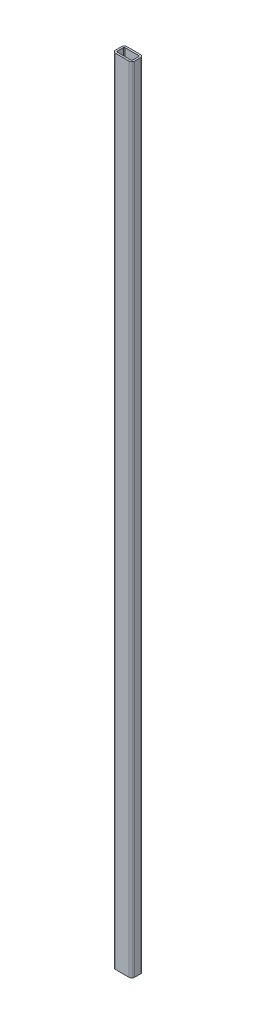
from build123d import *

# Parameters (mm, degrees)
SKETCH1_W                                 = 31.75
SKETCH1_H                                 = 19.05
HANDLE_BOSS_EXTRUDE1_DEPTH                = 1320.8
CORNER_FILLETS_R                          = 4.572
APPROXIMATE_COMPOSITE_CONSTRUCTION_SHEL_T = -3.048


with BuildPart() as part:
    # Sketch1 → Handle- Boss-Extrude1 (new body)
    with BuildSketch(Plane(origin=(0, 0, 0), x_dir=(1, 0, 0), z_dir=(0, 1, 0))):
        Rectangle(SKETCH1_W, SKETCH1_H)
    extrude(amount=HANDLE_BOSS_EXTRUDE1_DEPTH)

    # Corner Fillets
    corner_fillets_edges = [part.edges().sort_by_distance(p)[0] for p in [
        (15.875, 660.4, 9.525),
        (-15.875, 660.4, 9.525),
        (-15.875, 660.4, -9.525),
        (15.875, 660.4, -9.525),
    ]]
    fillet(corner_fillets_edges, radius=CORNER_FILLETS_R)

    # Approximate Composite Construction- Shel
    approximate_composite_construction_shel_openings = [part.faces().sort_by_distance(p)[0] for p in [
        (0, 1320.8, 0),
        (0, 0, 0),
    ]]
    offset(amount=APPROXIMATE_COMPOSITE_CONSTRUCTION_SHEL_T, openings=approximate_composite_construction_shel_openings, kind=Kind.INTERSECTION)


solid = part.part
